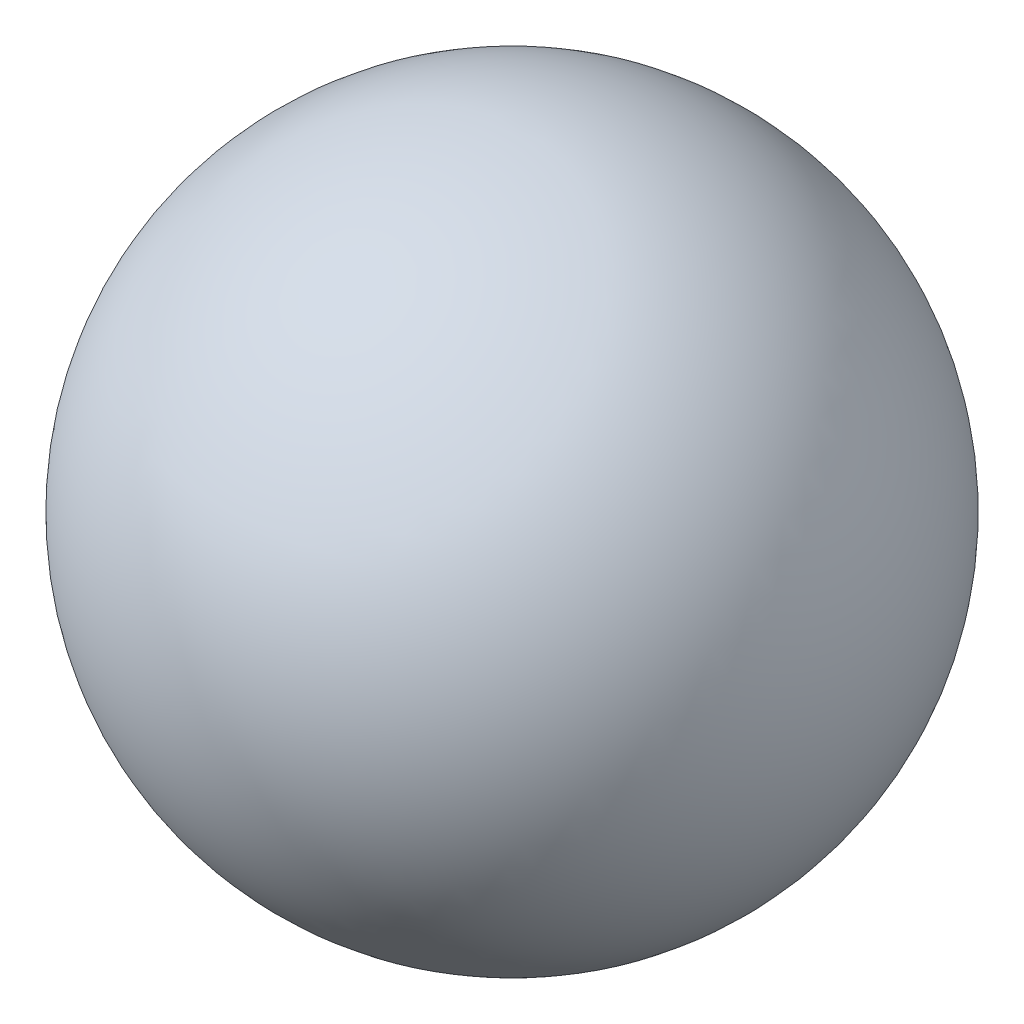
ISO-10303-21;
HEADER;
FILE_DESCRIPTION(('STEP AP214'),'2;1');
FILE_NAME('part.step','',(''),(''),'','','');
FILE_SCHEMA(('AUTOMOTIVE_DESIGN { 1 0 10303 214 1 1 1 1 }'));
ENDSEC;
DATA;
#1=APPLICATION_CONTEXT('core data for automotive mechanical design processes');
#2=APPLICATION_PROTOCOL_DEFINITION('international standard','automotive_design',2000,#1);
#3=PRODUCT_CONTEXT('',#1,'mechanical');
#4=PRODUCT('Part','Part','',(#3));
#5=PRODUCT_RELATED_PRODUCT_CATEGORY('part','',(#4));
#6=PRODUCT_DEFINITION_FORMATION('','',#4);
#7=PRODUCT_DEFINITION_CONTEXT('part definition',#1,'design');
#8=PRODUCT_DEFINITION('design','',#6,#7);
#9=PRODUCT_DEFINITION_SHAPE('','',#8);
#10=(LENGTH_UNIT() NAMED_UNIT(*) SI_UNIT(.MILLI.,.METRE.));
#11=(NAMED_UNIT(*) PLANE_ANGLE_UNIT() SI_UNIT($,.RADIAN.));
#12=(NAMED_UNIT(*) SI_UNIT($,.STERADIAN.) SOLID_ANGLE_UNIT());
#13=UNCERTAINTY_MEASURE_WITH_UNIT(LENGTH_MEASURE(1.E-05),#10,'distance_accuracy_value','');
#14=(GEOMETRIC_REPRESENTATION_CONTEXT(3) GLOBAL_UNCERTAINTY_ASSIGNED_CONTEXT((#13)) GLOBAL_UNIT_ASSIGNED_CONTEXT((#10,
#11,#12)) REPRESENTATION_CONTEXT('',''));
#15=CARTESIAN_POINT('',(0.,0.,0.));
#16=DIRECTION('',(0.,0.,1.));
#17=DIRECTION('',(1.,0.,0.));
#18=AXIS2_PLACEMENT_3D('',#15,#16,#17);
#19=CARTESIAN_POINT('',(0.,0.,0.));
#20=DIRECTION('',(0.,1.,0.));
#21=DIRECTION('',(1.,0.,0.));
#22=AXIS2_PLACEMENT_3D('',#19,#20,#21);
#23=SPHERICAL_SURFACE('',#22,48.875);
#24=CARTESIAN_POINT('',(0.,48.875,0.));
#25=VERTEX_POINT('',#24);
#26=VERTEX_LOOP('',#25);
#27=FACE_BOUND('',#26,.T.);
#28=ADVANCED_FACE('F31',(#27),#23,.T.);
#29=CLOSED_SHELL('',(#28));
#30=MANIFOLD_SOLID_BREP('B2',#29);
#31=ADVANCED_BREP_SHAPE_REPRESENTATION('',(#18,#30),#14);
#32=SHAPE_DEFINITION_REPRESENTATION(#9,#31);
ENDSEC;
END-ISO-10303-21;
